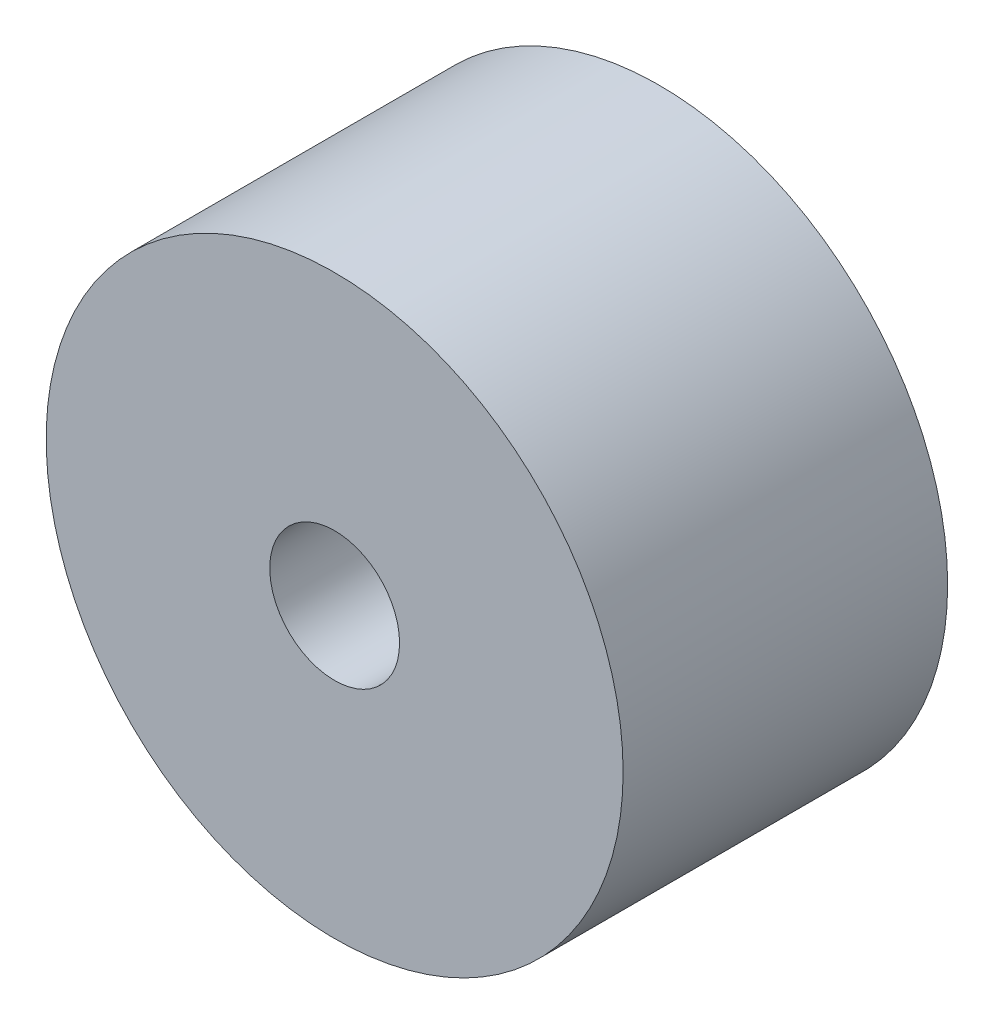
ISO-10303-21;
HEADER;
FILE_DESCRIPTION(('STEP AP214'),'2;1');
FILE_NAME('part.step','',(''),(''),'','','');
FILE_SCHEMA(('AUTOMOTIVE_DESIGN { 1 0 10303 214 1 1 1 1 }'));
ENDSEC;
DATA;
#1=APPLICATION_CONTEXT('core data for automotive mechanical design processes');
#2=APPLICATION_PROTOCOL_DEFINITION('international standard','automotive_design',2000,#1);
#3=PRODUCT_CONTEXT('',#1,'mechanical');
#4=PRODUCT('Part','Part','',(#3));
#5=PRODUCT_RELATED_PRODUCT_CATEGORY('part','',(#4));
#6=PRODUCT_DEFINITION_FORMATION('','',#4);
#7=PRODUCT_DEFINITION_CONTEXT('part definition',#1,'design');
#8=PRODUCT_DEFINITION('design','',#6,#7);
#9=PRODUCT_DEFINITION_SHAPE('','',#8);
#10=(LENGTH_UNIT() NAMED_UNIT(*) SI_UNIT(.MILLI.,.METRE.));
#11=(NAMED_UNIT(*) PLANE_ANGLE_UNIT() SI_UNIT($,.RADIAN.));
#12=(NAMED_UNIT(*) SI_UNIT($,.STERADIAN.) SOLID_ANGLE_UNIT());
#13=UNCERTAINTY_MEASURE_WITH_UNIT(LENGTH_MEASURE(1.E-05),#10,'distance_accuracy_value','');
#14=(GEOMETRIC_REPRESENTATION_CONTEXT(3) GLOBAL_UNCERTAINTY_ASSIGNED_CONTEXT((#13)) GLOBAL_UNIT_ASSIGNED_CONTEXT((#10,
#11,#12)) REPRESENTATION_CONTEXT('',''));
#15=CARTESIAN_POINT('',(0.,0.,0.));
#16=DIRECTION('',(0.,0.,1.));
#17=DIRECTION('',(1.,0.,0.));
#18=AXIS2_PLACEMENT_3D('',#15,#16,#17);
#19=CARTESIAN_POINT('',(0.,0.,4.5));
#20=DIRECTION('',(0.,0.,1.));
#21=DIRECTION('',(1.,0.,0.));
#22=AXIS2_PLACEMENT_3D('',#19,#20,#21);
#23=PLANE('',#22);
#24=CARTESIAN_POINT('',(0.,0.,4.5));
#25=DIRECTION('',(0.,0.,1.));
#26=DIRECTION('',(1.,0.,0.));
#27=AXIS2_PLACEMENT_3D('',#24,#25,#26);
#28=CIRCLE('',#27,4.);
#29=CARTESIAN_POINT('',(4.,0.,4.5));
#30=VERTEX_POINT('',#29);
#31=EDGE_CURVE('E10',#30,#30,#28,.T.);
#32=ORIENTED_EDGE('',*,*,#31,.T.);
#33=EDGE_LOOP('',(#32));
#34=FACE_BOUND('',#33,.T.);
#35=CARTESIAN_POINT('',(0.,0.,4.5));
#36=DIRECTION('',(0.,0.,1.));
#37=DIRECTION('',(1.,0.,0.));
#38=AXIS2_PLACEMENT_3D('',#35,#36,#37);
#39=CIRCLE('',#38,0.9);
#40=CARTESIAN_POINT('',(0.9,0.,4.5));
#41=VERTEX_POINT('',#40);
#42=EDGE_CURVE('E56',#41,#41,#39,.T.);
#43=ORIENTED_EDGE('',*,*,#42,.F.);
#44=EDGE_LOOP('',(#43));
#45=FACE_BOUND('',#44,.T.);
#46=ADVANCED_FACE('F43',(#34,#45),#23,.T.);
#47=CARTESIAN_POINT('',(0.,0.,0.));
#48=DIRECTION('',(0.,0.,1.));
#49=DIRECTION('',(1.,0.,0.));
#50=AXIS2_PLACEMENT_3D('',#47,#48,#49);
#51=PLANE('',#50);
#52=CARTESIAN_POINT('',(0.,0.,0.));
#53=DIRECTION('',(0.,0.,1.));
#54=DIRECTION('',(1.,0.,0.));
#55=AXIS2_PLACEMENT_3D('',#52,#53,#54);
#56=CIRCLE('',#55,4.);
#57=CARTESIAN_POINT('',(4.,0.,0.));
#58=VERTEX_POINT('',#57);
#59=EDGE_CURVE('E47',#58,#58,#56,.T.);
#60=ORIENTED_EDGE('',*,*,#59,.F.);
#61=EDGE_LOOP('',(#60));
#62=FACE_BOUND('',#61,.T.);
#63=CARTESIAN_POINT('',(0.,0.,0.));
#64=DIRECTION('',(0.,0.,1.));
#65=DIRECTION('',(1.,0.,0.));
#66=AXIS2_PLACEMENT_3D('',#63,#64,#65);
#67=CIRCLE('',#66,0.9);
#68=CARTESIAN_POINT('',(0.9,0.,0.));
#69=VERTEX_POINT('',#68);
#70=EDGE_CURVE('E58',#69,#69,#67,.T.);
#71=ORIENTED_EDGE('',*,*,#70,.T.);
#72=EDGE_LOOP('',(#71));
#73=FACE_BOUND('',#72,.T.);
#74=ADVANCED_FACE('F70',(#62,#73),#51,.F.);
#75=CARTESIAN_POINT('',(0.,0.,4.5));
#76=DIRECTION('',(0.,0.,-1.));
#77=DIRECTION('',(-1.,0.,0.));
#78=AXIS2_PLACEMENT_3D('',#75,#76,#77);
#79=CYLINDRICAL_SURFACE('',#78,4.);
#80=ORIENTED_EDGE('',*,*,#31,.F.);
#81=EDGE_LOOP('',(#80));
#82=FACE_BOUND('',#81,.T.);
#83=ORIENTED_EDGE('',*,*,#59,.T.);
#84=EDGE_LOOP('',(#83));
#85=FACE_BOUND('',#84,.T.);
#86=ADVANCED_FACE('F45',(#82,#85),#79,.T.);
#87=CARTESIAN_POINT('',(0.,0.,4.5));
#88=DIRECTION('',(0.,0.,-1.));
#89=DIRECTION('',(-1.,0.,0.));
#90=AXIS2_PLACEMENT_3D('',#87,#88,#89);
#91=CYLINDRICAL_SURFACE('',#90,0.9);
#92=ORIENTED_EDGE('',*,*,#42,.T.);
#93=EDGE_LOOP('',(#92));
#94=FACE_BOUND('',#93,.T.);
#95=ORIENTED_EDGE('',*,*,#70,.F.);
#96=EDGE_LOOP('',(#95));
#97=FACE_BOUND('',#96,.T.);
#98=ADVANCED_FACE('F66',(#94,#97),#91,.F.);
#99=CLOSED_SHELL('',(#46,#74,#86,#98));
#100=MANIFOLD_SOLID_BREP('B2',#99);
#101=ADVANCED_BREP_SHAPE_REPRESENTATION('',(#18,#100),#14);
#102=SHAPE_DEFINITION_REPRESENTATION(#9,#101);
ENDSEC;
END-ISO-10303-21;
